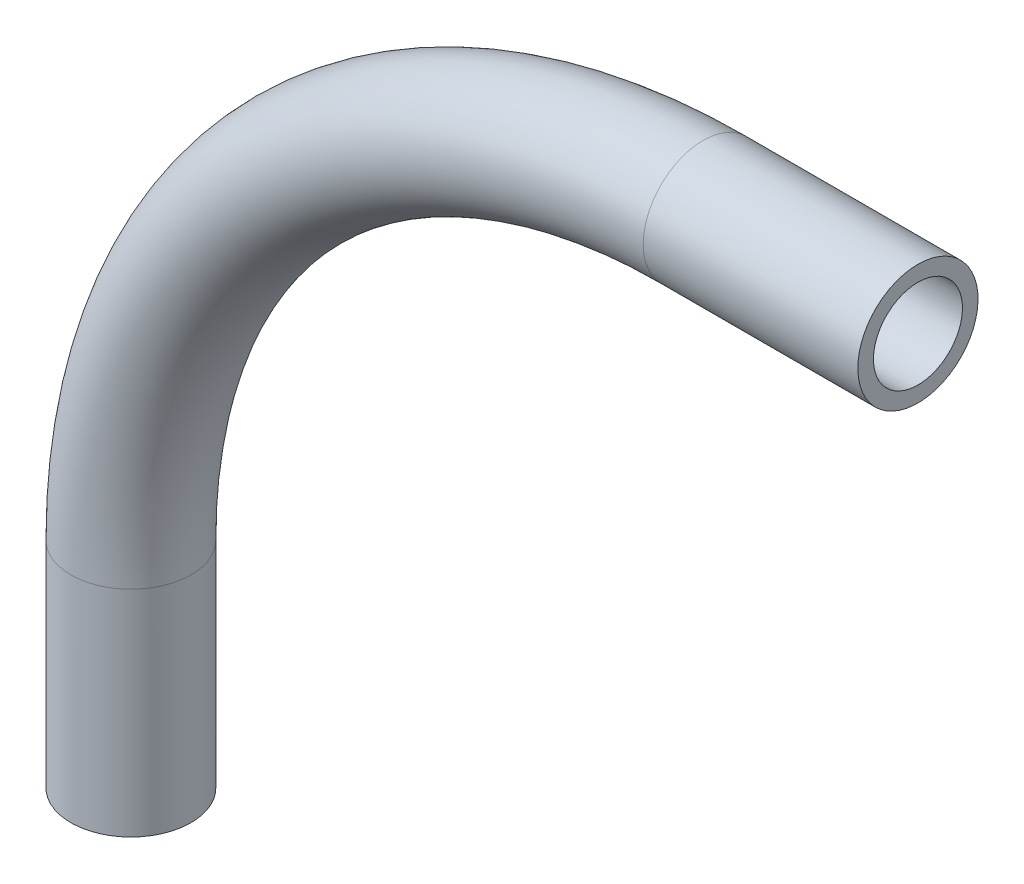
ISO-10303-21;
HEADER;
FILE_DESCRIPTION(('STEP AP214'),'2;1');
FILE_NAME('part.step','',(''),(''),'','','');
FILE_SCHEMA(('AUTOMOTIVE_DESIGN { 1 0 10303 214 1 1 1 1 }'));
ENDSEC;
DATA;
#1=APPLICATION_CONTEXT('core data for automotive mechanical design processes');
#2=APPLICATION_PROTOCOL_DEFINITION('international standard','automotive_design',2000,#1);
#3=PRODUCT_CONTEXT('',#1,'mechanical');
#4=PRODUCT('Part','Part','',(#3));
#5=PRODUCT_RELATED_PRODUCT_CATEGORY('part','',(#4));
#6=PRODUCT_DEFINITION_FORMATION('','',#4);
#7=PRODUCT_DEFINITION_CONTEXT('part definition',#1,'design');
#8=PRODUCT_DEFINITION('design','',#6,#7);
#9=PRODUCT_DEFINITION_SHAPE('','',#8);
#10=(LENGTH_UNIT() NAMED_UNIT(*) SI_UNIT(.MILLI.,.METRE.));
#11=(NAMED_UNIT(*) PLANE_ANGLE_UNIT() SI_UNIT($,.RADIAN.));
#12=(NAMED_UNIT(*) SI_UNIT($,.STERADIAN.) SOLID_ANGLE_UNIT());
#13=UNCERTAINTY_MEASURE_WITH_UNIT(LENGTH_MEASURE(1.E-05),#10,'distance_accuracy_value','');
#14=(GEOMETRIC_REPRESENTATION_CONTEXT(3) GLOBAL_UNCERTAINTY_ASSIGNED_CONTEXT((#13)) GLOBAL_UNIT_ASSIGNED_CONTEXT((#10,
#11,#12)) REPRESENTATION_CONTEXT('',''));
#15=CARTESIAN_POINT('',(0.,0.,0.));
#16=DIRECTION('',(0.,0.,1.));
#17=DIRECTION('',(1.,0.,0.));
#18=AXIS2_PLACEMENT_3D('',#15,#16,#17);
#19=CARTESIAN_POINT('',(0.,0.,0.));
#20=DIRECTION('',(0.,0.,1.));
#21=DIRECTION('',(1.,0.,0.));
#22=AXIS2_PLACEMENT_3D('',#19,#20,#21);
#23=TOROIDAL_SURFACE('',#22,101.6,10.668);
#24=CARTESIAN_POINT('',(3.32174772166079E-13,101.6,0.));
#25=DIRECTION('',(1.,0.,0.));
#26=DIRECTION('',(0.,0.,1.));
#27=AXIS2_PLACEMENT_3D('',#24,#25,#26);
#28=CIRCLE('',#27,10.668);
#29=CARTESIAN_POINT('',(3.67053123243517E-13,112.268,0.));
#30=VERTEX_POINT('',#29);
#31=EDGE_CURVE('E10',#30,#30,#28,.T.);
#32=CARTESIAN_POINT('',(-101.6,0.,0.));
#33=DIRECTION('',(0.,-1.,0.));
#34=DIRECTION('',(0.,0.,-1.));
#35=AXIS2_PLACEMENT_3D('',#32,#33,#34);
#36=CIRCLE('',#35,10.668);
#37=CARTESIAN_POINT('',(-112.268,0.,0.));
#38=VERTEX_POINT('',#37);
#39=EDGE_CURVE('E55',#38,#38,#36,.T.);
#40=CARTESIAN_POINT('',(0.,0.,0.));
#41=DIRECTION('',(0.,0.,1.));
#42=DIRECTION('',(1.,0.,0.));
#43=AXIS2_PLACEMENT_3D('',#40,#41,#42);
#44=CIRCLE('',#43,112.268);
#45=EDGE_CURVE('',#30,#38,#44,.T.);
#46=ORIENTED_EDGE('',*,*,#31,.F.);
#47=ORIENTED_EDGE('',*,*,#39,.F.);
#48=ORIENTED_EDGE('',*,*,#45,.T.);
#49=ORIENTED_EDGE('',*,*,#45,.F.);
#50=EDGE_LOOP('',(#46,#48,#47,#49));
#51=FACE_BOUND('',#50,.T.);
#52=ADVANCED_FACE('F32',(#51),#23,.T.);
#53=CARTESIAN_POINT('',(0.,0.,0.));
#54=DIRECTION('',(0.,0.,1.));
#55=DIRECTION('',(1.,0.,0.));
#56=AXIS2_PLACEMENT_3D('',#53,#54,#55);
#57=TOROIDAL_SURFACE('',#56,101.6,7.8994);
#58=CARTESIAN_POINT('',(3.32174772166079E-13,101.6,0.));
#59=DIRECTION('',(1.,0.,0.));
#60=DIRECTION('',(0.,1.,0.));
#61=AXIS2_PLACEMENT_3D('',#58,#59,#60);
#62=CIRCLE('',#61,7.89940000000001);
#63=CARTESIAN_POINT('',(3.58001360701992E-13,109.4994,0.));
#64=VERTEX_POINT('',#63);
#65=EDGE_CURVE('E49',#64,#64,#62,.T.);
#66=CARTESIAN_POINT('',(-101.6,0.,0.));
#67=DIRECTION('',(0.,1.,0.));
#68=DIRECTION('',(0.,0.,1.));
#69=AXIS2_PLACEMENT_3D('',#66,#67,#68);
#70=CIRCLE('',#69,7.8994);
#71=CARTESIAN_POINT('',(-109.4994,0.,0.));
#72=VERTEX_POINT('',#71);
#73=EDGE_CURVE('E38',#72,#72,#70,.T.);
#74=CARTESIAN_POINT('',(0.,0.,0.));
#75=DIRECTION('',(0.,0.,1.));
#76=DIRECTION('',(1.,0.,0.));
#77=AXIS2_PLACEMENT_3D('',#74,#75,#76);
#78=CIRCLE('',#77,109.4994);
#79=EDGE_CURVE('',#64,#72,#78,.T.);
#80=ORIENTED_EDGE('',*,*,#65,.T.);
#81=ORIENTED_EDGE('',*,*,#73,.F.);
#82=ORIENTED_EDGE('',*,*,#79,.T.);
#83=ORIENTED_EDGE('',*,*,#79,.F.);
#84=EDGE_LOOP('',(#80,#82,#81,#83));
#85=FACE_BOUND('',#84,.T.);
#86=ADVANCED_FACE('F83',(#85),#57,.F.);
#87=CARTESIAN_POINT('',(38.1000000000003,101.6,0.));
#88=DIRECTION('',(1.,0.,0.));
#89=DIRECTION('',(0.,1.,0.));
#90=AXIS2_PLACEMENT_3D('',#87,#88,#89);
#91=PLANE('',#90);
#92=CARTESIAN_POINT('',(38.1000000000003,101.6,0.));
#93=DIRECTION('',(1.,0.,0.));
#94=DIRECTION('',(0.,1.,0.));
#95=AXIS2_PLACEMENT_3D('',#92,#93,#94);
#96=CIRCLE('',#95,10.668);
#97=CARTESIAN_POINT('',(38.1000000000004,112.268,0.));
#98=VERTEX_POINT('',#97);
#99=EDGE_CURVE('E42',#98,#98,#96,.T.);
#100=ORIENTED_EDGE('',*,*,#99,.T.);
#101=EDGE_LOOP('',(#100));
#102=FACE_BOUND('',#101,.T.);
#103=CARTESIAN_POINT('',(38.1000000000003,101.6,0.));
#104=DIRECTION('',(1.,0.,0.));
#105=DIRECTION('',(0.,1.,0.));
#106=AXIS2_PLACEMENT_3D('',#103,#104,#105);
#107=CIRCLE('',#106,7.89940000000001);
#108=CARTESIAN_POINT('',(38.1000000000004,109.4994,0.));
#109=VERTEX_POINT('',#108);
#110=EDGE_CURVE('E46',#109,#109,#107,.T.);
#111=ORIENTED_EDGE('',*,*,#110,.F.);
#112=EDGE_LOOP('',(#111));
#113=FACE_BOUND('',#112,.T.);
#114=ADVANCED_FACE('F88',(#102,#113),#91,.T.);
#115=CARTESIAN_POINT('',(38.1000000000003,101.6,0.));
#116=DIRECTION('',(-1.,0.,0.));
#117=DIRECTION('',(0.,-1.,0.));
#118=AXIS2_PLACEMENT_3D('',#115,#116,#117);
#119=CYLINDRICAL_SURFACE('',#118,10.668);
#120=ORIENTED_EDGE('',*,*,#99,.F.);
#121=EDGE_LOOP('',(#120));
#122=FACE_BOUND('',#121,.T.);
#123=ORIENTED_EDGE('',*,*,#31,.T.);
#124=EDGE_LOOP('',(#123));
#125=FACE_BOUND('',#124,.T.);
#126=ADVANCED_FACE('F78',(#122,#125),#119,.T.);
#127=CARTESIAN_POINT('',(38.1000000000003,101.6,0.));
#128=DIRECTION('',(-1.,0.,0.));
#129=DIRECTION('',(0.,-1.,0.));
#130=AXIS2_PLACEMENT_3D('',#127,#128,#129);
#131=CYLINDRICAL_SURFACE('',#130,7.89940000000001);
#132=ORIENTED_EDGE('',*,*,#110,.T.);
#133=EDGE_LOOP('',(#132));
#134=FACE_BOUND('',#133,.T.);
#135=ORIENTED_EDGE('',*,*,#65,.F.);
#136=EDGE_LOOP('',(#135));
#137=FACE_BOUND('',#136,.T.);
#138=ADVANCED_FACE('F69',(#134,#137),#131,.F.);
#139=CARTESIAN_POINT('',(-101.6,-38.1,0.));
#140=DIRECTION('',(0.,-1.,0.));
#141=DIRECTION('',(0.,0.,-1.));
#142=AXIS2_PLACEMENT_3D('',#139,#140,#141);
#143=PLANE('',#142);
#144=CARTESIAN_POINT('',(-101.6,-38.1,0.));
#145=DIRECTION('',(0.,-1.,0.));
#146=DIRECTION('',(0.,0.,-1.));
#147=AXIS2_PLACEMENT_3D('',#144,#145,#146);
#148=CIRCLE('',#147,10.668);
#149=CARTESIAN_POINT('',(-101.6,-38.1,-10.668));
#150=VERTEX_POINT('',#149);
#151=EDGE_CURVE('E52',#150,#150,#148,.T.);
#152=ORIENTED_EDGE('',*,*,#151,.T.);
#153=EDGE_LOOP('',(#152));
#154=FACE_BOUND('',#153,.T.);
#155=CARTESIAN_POINT('',(-101.6,-38.1,0.));
#156=DIRECTION('',(0.,-1.,0.));
#157=DIRECTION('',(0.,0.,-1.));
#158=AXIS2_PLACEMENT_3D('',#155,#156,#157);
#159=CIRCLE('',#158,7.8994);
#160=CARTESIAN_POINT('',(-101.6,-38.1,-7.8994));
#161=VERTEX_POINT('',#160);
#162=EDGE_CURVE('E58',#161,#161,#159,.T.);
#163=ORIENTED_EDGE('',*,*,#162,.F.);
#164=EDGE_LOOP('',(#163));
#165=FACE_BOUND('',#164,.T.);
#166=ADVANCED_FACE('F66',(#154,#165),#143,.T.);
#167=CARTESIAN_POINT('',(-101.6,-38.1,0.));
#168=DIRECTION('',(0.,1.,0.));
#169=DIRECTION('',(0.,0.,1.));
#170=AXIS2_PLACEMENT_3D('',#167,#168,#169);
#171=CYLINDRICAL_SURFACE('',#170,10.668);
#172=ORIENTED_EDGE('',*,*,#151,.F.);
#173=EDGE_LOOP('',(#172));
#174=FACE_BOUND('',#173,.T.);
#175=ORIENTED_EDGE('',*,*,#39,.T.);
#176=EDGE_LOOP('',(#175));
#177=FACE_BOUND('',#176,.T.);
#178=ADVANCED_FACE('F68',(#174,#177),#171,.T.);
#179=CARTESIAN_POINT('',(-101.6,-38.1,0.));
#180=DIRECTION('',(0.,1.,0.));
#181=DIRECTION('',(0.,0.,1.));
#182=AXIS2_PLACEMENT_3D('',#179,#180,#181);
#183=CYLINDRICAL_SURFACE('',#182,7.8994);
#184=ORIENTED_EDGE('',*,*,#162,.T.);
#185=EDGE_LOOP('',(#184));
#186=FACE_BOUND('',#185,.T.);
#187=ORIENTED_EDGE('',*,*,#73,.T.);
#188=EDGE_LOOP('',(#187));
#189=FACE_BOUND('',#188,.T.);
#190=ADVANCED_FACE('F64',(#186,#189),#183,.F.);
#191=CLOSED_SHELL('',(#52,#86,#114,#126,#138,#166,#178,#190));
#192=MANIFOLD_SOLID_BREP('B2',#191);
#193=ADVANCED_BREP_SHAPE_REPRESENTATION('',(#18,#192),#14);
#194=SHAPE_DEFINITION_REPRESENTATION(#9,#193);
ENDSEC;
END-ISO-10303-21;
